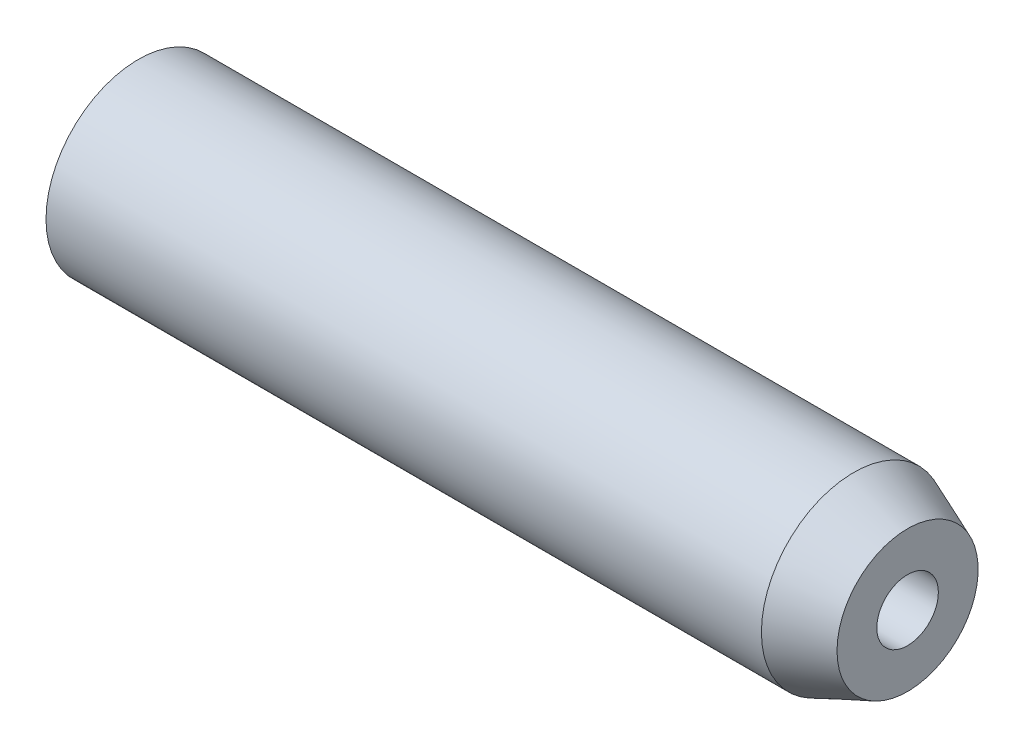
ISO-10303-21;
HEADER;
FILE_DESCRIPTION(('STEP AP214'),'2;1');
FILE_NAME('part.step','',(''),(''),'','','');
FILE_SCHEMA(('AUTOMOTIVE_DESIGN { 1 0 10303 214 1 1 1 1 }'));
ENDSEC;
DATA;
#1=APPLICATION_CONTEXT('core data for automotive mechanical design processes');
#2=APPLICATION_PROTOCOL_DEFINITION('international standard','automotive_design',2000,#1);
#3=PRODUCT_CONTEXT('',#1,'mechanical');
#4=PRODUCT('Part','Part','',(#3));
#5=PRODUCT_RELATED_PRODUCT_CATEGORY('part','',(#4));
#6=PRODUCT_DEFINITION_FORMATION('','',#4);
#7=PRODUCT_DEFINITION_CONTEXT('part definition',#1,'design');
#8=PRODUCT_DEFINITION('design','',#6,#7);
#9=PRODUCT_DEFINITION_SHAPE('','',#8);
#10=(LENGTH_UNIT() NAMED_UNIT(*) SI_UNIT(.MILLI.,.METRE.));
#11=(NAMED_UNIT(*) PLANE_ANGLE_UNIT() SI_UNIT($,.RADIAN.));
#12=(NAMED_UNIT(*) SI_UNIT($,.STERADIAN.) SOLID_ANGLE_UNIT());
#13=UNCERTAINTY_MEASURE_WITH_UNIT(LENGTH_MEASURE(1.E-05),#10,'distance_accuracy_value','');
#14=(GEOMETRIC_REPRESENTATION_CONTEXT(3) GLOBAL_UNCERTAINTY_ASSIGNED_CONTEXT((#13)) GLOBAL_UNIT_ASSIGNED_CONTEXT((#10,
#11,#12)) REPRESENTATION_CONTEXT('',''));
#15=CARTESIAN_POINT('',(0.,0.,0.));
#16=DIRECTION('',(0.,0.,1.));
#17=DIRECTION('',(1.,0.,0.));
#18=AXIS2_PLACEMENT_3D('',#15,#16,#17);
#19=CARTESIAN_POINT('',(0.,0.,0.));
#20=DIRECTION('',(1.,0.,0.));
#21=DIRECTION('',(0.,0.,-1.));
#22=AXIS2_PLACEMENT_3D('',#19,#20,#21);
#23=PLANE('',#22);
#24=CARTESIAN_POINT('',(0.,0.,0.));
#25=DIRECTION('',(-1.,0.,0.));
#26=DIRECTION('',(0.,0.,1.));
#27=AXIS2_PLACEMENT_3D('',#24,#25,#26);
#28=CIRCLE('',#27,6.);
#29=CARTESIAN_POINT('',(0.,0.,6.));
#30=VERTEX_POINT('',#29);
#31=EDGE_CURVE('E31',#30,#30,#28,.T.);
#32=ORIENTED_EDGE('',*,*,#31,.F.);
#33=EDGE_LOOP('',(#32));
#34=FACE_BOUND('',#33,.T.);
#35=CARTESIAN_POINT('',(0.,0.,0.));
#36=DIRECTION('',(-1.,0.,0.));
#37=DIRECTION('',(0.,0.,1.));
#38=AXIS2_PLACEMENT_3D('',#35,#36,#37);
#39=CIRCLE('',#38,12.);
#40=CARTESIAN_POINT('',(0.,0.,12.));
#41=VERTEX_POINT('',#40);
#42=EDGE_CURVE('E9',#41,#41,#39,.T.);
#43=ORIENTED_EDGE('',*,*,#42,.T.);
#44=EDGE_LOOP('',(#43));
#45=FACE_BOUND('',#44,.T.);
#46=ADVANCED_FACE('F14',(#34,#45),#23,.F.);
#47=CARTESIAN_POINT('',(0.,0.,0.));
#48=DIRECTION('',(-1.,0.,0.));
#49=DIRECTION('',(0.,0.,1.));
#50=AXIS2_PLACEMENT_3D('',#47,#48,#49);
#51=CYLINDRICAL_SURFACE('',#50,12.);
#52=ORIENTED_EDGE('',*,*,#42,.F.);
#53=EDGE_LOOP('',(#52));
#54=FACE_BOUND('',#53,.T.);
#55=CARTESIAN_POINT('',(93.,0.,0.));
#56=DIRECTION('',(-1.,0.,0.));
#57=DIRECTION('',(0.,0.,1.));
#58=AXIS2_PLACEMENT_3D('',#55,#56,#57);
#59=CIRCLE('',#58,12.);
#60=CARTESIAN_POINT('',(93.,0.,12.));
#61=VERTEX_POINT('',#60);
#62=EDGE_CURVE('E20',#61,#61,#59,.T.);
#63=ORIENTED_EDGE('',*,*,#62,.T.);
#64=EDGE_LOOP('',(#63));
#65=FACE_BOUND('',#64,.T.);
#66=ADVANCED_FACE('F61',(#54,#65),#51,.T.);
#67=CARTESIAN_POINT('',(100.,0.,0.));
#68=DIRECTION('',(-1.,0.,0.));
#69=DIRECTION('',(0.,0.,1.));
#70=AXIS2_PLACEMENT_3D('',#67,#68,#69);
#71=CONICAL_SURFACE('',#70,9.17181641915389,0.383972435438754);
#72=ORIENTED_EDGE('',*,*,#62,.F.);
#73=EDGE_LOOP('',(#72));
#74=FACE_BOUND('',#73,.T.);
#75=CARTESIAN_POINT('',(100.,0.,0.));
#76=DIRECTION('',(-1.,0.,0.));
#77=DIRECTION('',(0.,0.,1.));
#78=AXIS2_PLACEMENT_3D('',#75,#76,#77);
#79=CIRCLE('',#78,9.17181641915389);
#80=CARTESIAN_POINT('',(100.,0.,9.17181641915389));
#81=VERTEX_POINT('',#80);
#82=EDGE_CURVE('E24',#81,#81,#79,.T.);
#83=ORIENTED_EDGE('',*,*,#82,.T.);
#84=EDGE_LOOP('',(#83));
#85=FACE_BOUND('',#84,.T.);
#86=ADVANCED_FACE('F56',(#74,#85),#71,.T.);
#87=CARTESIAN_POINT('',(100.,9.17181641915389,0.));
#88=DIRECTION('',(-1.,0.,0.));
#89=DIRECTION('',(0.,0.,1.));
#90=AXIS2_PLACEMENT_3D('',#87,#88,#89);
#91=PLANE('',#90);
#92=CARTESIAN_POINT('',(100.,0.,0.));
#93=DIRECTION('',(1.,0.,0.));
#94=DIRECTION('',(0.,0.,-1.));
#95=AXIS2_PLACEMENT_3D('',#92,#93,#94);
#96=CIRCLE('',#95,4.);
#97=CARTESIAN_POINT('',(100.,0.,-4.));
#98=VERTEX_POINT('',#97);
#99=EDGE_CURVE('E37',#98,#98,#96,.T.);
#100=ORIENTED_EDGE('',*,*,#99,.F.);
#101=EDGE_LOOP('',(#100));
#102=FACE_BOUND('',#101,.T.);
#103=ORIENTED_EDGE('',*,*,#82,.F.);
#104=EDGE_LOOP('',(#103));
#105=FACE_BOUND('',#104,.T.);
#106=ADVANCED_FACE('F52',(#102,#105),#91,.F.);
#107=CARTESIAN_POINT('',(35.,0.,0.));
#108=DIRECTION('',(-1.,0.,0.));
#109=DIRECTION('',(0.,0.,1.));
#110=AXIS2_PLACEMENT_3D('',#107,#108,#109);
#111=CYLINDRICAL_SURFACE('',#110,6.);
#112=CARTESIAN_POINT('',(35.,0.,0.));
#113=DIRECTION('',(-1.,0.,0.));
#114=DIRECTION('',(0.,0.,1.));
#115=AXIS2_PLACEMENT_3D('',#112,#113,#114);
#116=CIRCLE('',#115,6.);
#117=CARTESIAN_POINT('',(35.,0.,6.));
#118=VERTEX_POINT('',#117);
#119=EDGE_CURVE('E28',#118,#118,#116,.T.);
#120=ORIENTED_EDGE('',*,*,#119,.F.);
#121=EDGE_LOOP('',(#120));
#122=FACE_BOUND('',#121,.T.);
#123=ORIENTED_EDGE('',*,*,#31,.T.);
#124=EDGE_LOOP('',(#123));
#125=FACE_BOUND('',#124,.T.);
#126=ADVANCED_FACE('F55',(#122,#125),#111,.F.);
#127=CARTESIAN_POINT('',(35.,0.,0.));
#128=DIRECTION('',(-1.,0.,0.));
#129=DIRECTION('',(0.,0.,1.));
#130=AXIS2_PLACEMENT_3D('',#127,#128,#129);
#131=PLANE('',#130);
#132=ORIENTED_EDGE('',*,*,#119,.T.);
#133=EDGE_LOOP('',(#132));
#134=FACE_BOUND('',#133,.T.);
#135=ADVANCED_FACE('F48',(#134),#131,.T.);
#136=CARTESIAN_POINT('',(93.,0.,0.));
#137=DIRECTION('',(1.,0.,0.));
#138=DIRECTION('',(0.,0.,-1.));
#139=AXIS2_PLACEMENT_3D('',#136,#137,#138);
#140=CYLINDRICAL_SURFACE('',#139,4.);
#141=CARTESIAN_POINT('',(93.,0.,0.));
#142=DIRECTION('',(1.,0.,0.));
#143=DIRECTION('',(0.,0.,-1.));
#144=AXIS2_PLACEMENT_3D('',#141,#142,#143);
#145=CIRCLE('',#144,4.);
#146=CARTESIAN_POINT('',(93.,0.,-4.));
#147=VERTEX_POINT('',#146);
#148=EDGE_CURVE('E34',#147,#147,#145,.T.);
#149=ORIENTED_EDGE('',*,*,#148,.F.);
#150=EDGE_LOOP('',(#149));
#151=FACE_BOUND('',#150,.T.);
#152=ORIENTED_EDGE('',*,*,#99,.T.);
#153=EDGE_LOOP('',(#152));
#154=FACE_BOUND('',#153,.T.);
#155=ADVANCED_FACE('F45',(#151,#154),#140,.F.);
#156=CARTESIAN_POINT('',(93.,0.,0.));
#157=DIRECTION('',(1.,0.,0.));
#158=DIRECTION('',(0.,0.,-1.));
#159=AXIS2_PLACEMENT_3D('',#156,#157,#158);
#160=PLANE('',#159);
#161=ORIENTED_EDGE('',*,*,#148,.T.);
#162=EDGE_LOOP('',(#161));
#163=FACE_BOUND('',#162,.T.);
#164=ADVANCED_FACE('F43',(#163),#160,.T.);
#165=CLOSED_SHELL('',(#46,#66,#86,#106,#126,#135,#155,#164));
#166=MANIFOLD_SOLID_BREP('B1',#165);
#167=ADVANCED_BREP_SHAPE_REPRESENTATION('',(#18,#166),#14);
#168=SHAPE_DEFINITION_REPRESENTATION(#9,#167);
ENDSEC;
END-ISO-10303-21;
